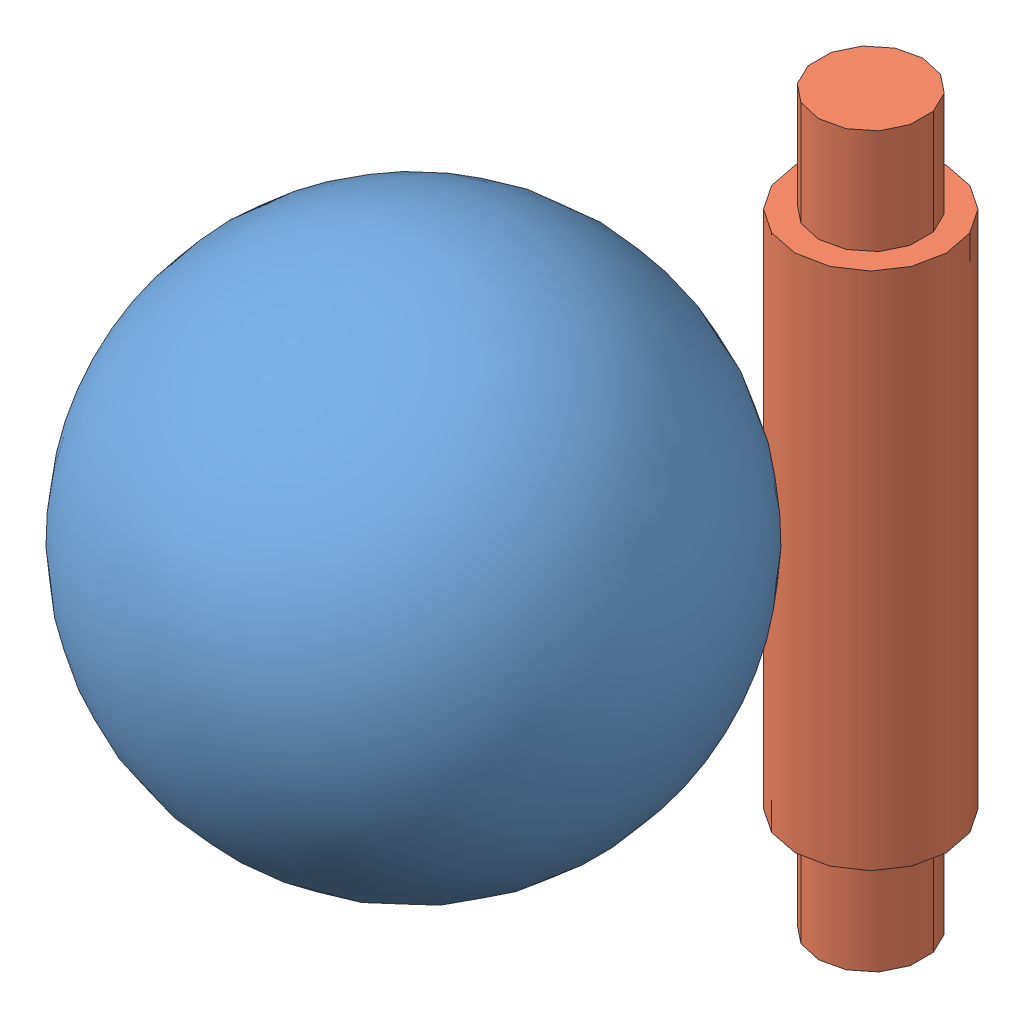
SolidWorks assembly tangent mate.SLDASM, configuration Default (file format 11000). Lengths in mm.
Overall size (150 210.19 181.3).
2 component instances, 2 part files, 1 mates.
Components (placement in the parent):
- sphere-1: sphere.SLDPRT [Default] at origin size (150 150 150)
- end pin-1: end pin.SLDPRT [Default] at (47.5304 -11.0483 -84.42) size (43.76 210.19 43.76)
Mates (geometry in assembly coordinates):
- Tangent4: tangent: sphere of assembly; cylinder of assembly; sphere of sphere-1; cylinder of end pin-1 through (47.5304 100.9735 -84.42) axis (0 1 0) radius 21.8807
